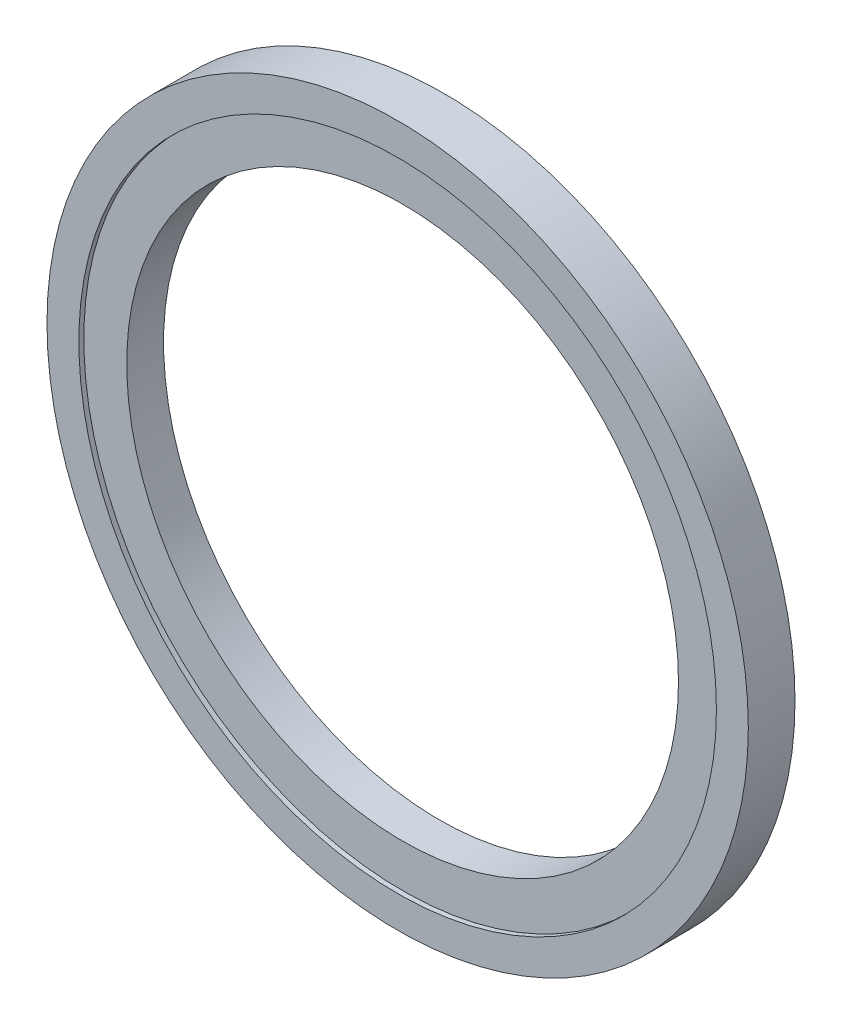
from build123d import *

# Parameters (mm, degrees)
BOSS_EXTRUDE1_DEPTH      = 19.05
BOSS_EXTRUDE1_DEPTH_BACK = 19.05
SKETCH1_R                = 286
SKETCH1_R_2              = 260
BOSS_EXTRUDE2_DEPTH      = 15
BOSS_EXTRUDE2_DEPTH_BACK = 15
SKETCH1_3_R              = 260
SKETCH1_3_R_2            = 225


with BuildPart() as part:
    # Sketch1 → Boss-Extrude1 (new, two sides: drawn at the far end of the back side and taken through both)
    with BuildSketch(Plane.XY.offset(-BOSS_EXTRUDE1_DEPTH_BACK)):
        Circle(SKETCH1_R)
        Circle(SKETCH1_R_2, mode=Mode.SUBTRACT)
    extrude(amount=BOSS_EXTRUDE1_DEPTH + BOSS_EXTRUDE1_DEPTH_BACK)

    # Sketch1_3 → Boss-Extrude2 (add, two sides: drawn at the far end of the back side and taken through both)
    with BuildSketch(Plane.XY.offset(-BOSS_EXTRUDE2_DEPTH_BACK)):
        Circle(SKETCH1_3_R)
        Circle(SKETCH1_3_R_2, mode=Mode.SUBTRACT)
    extrude(amount=BOSS_EXTRUDE2_DEPTH + BOSS_EXTRUDE2_DEPTH_BACK)


solid = part.part
